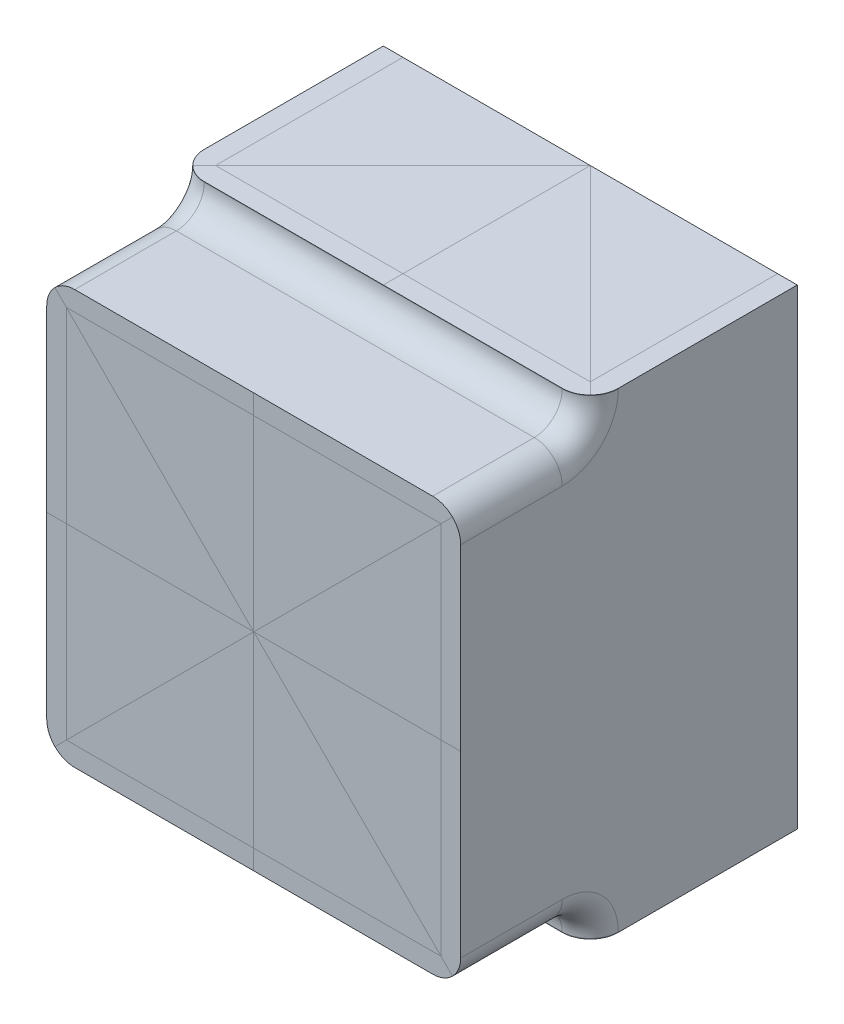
ISO-10303-21;
HEADER;
FILE_DESCRIPTION(('STEP AP214'),'2;1');
FILE_NAME('part.step','',(''),(''),'','','');
FILE_SCHEMA(('AUTOMOTIVE_DESIGN { 1 0 10303 214 1 1 1 1 }'));
ENDSEC;
DATA;
#1=APPLICATION_CONTEXT('core data for automotive mechanical design processes');
#2=APPLICATION_PROTOCOL_DEFINITION('international standard','automotive_design',2000,#1);
#3=PRODUCT_CONTEXT('',#1,'mechanical');
#4=PRODUCT('Part','Part','',(#3));
#5=PRODUCT_RELATED_PRODUCT_CATEGORY('part','',(#4));
#6=PRODUCT_DEFINITION_FORMATION('','',#4);
#7=PRODUCT_DEFINITION_CONTEXT('part definition',#1,'design');
#8=PRODUCT_DEFINITION('design','',#6,#7);
#9=PRODUCT_DEFINITION_SHAPE('','',#8);
#10=(LENGTH_UNIT() NAMED_UNIT(*) SI_UNIT(.MILLI.,.METRE.));
#11=(NAMED_UNIT(*) PLANE_ANGLE_UNIT() SI_UNIT($,.RADIAN.));
#12=(NAMED_UNIT(*) SI_UNIT($,.STERADIAN.) SOLID_ANGLE_UNIT());
#13=UNCERTAINTY_MEASURE_WITH_UNIT(LENGTH_MEASURE(1.E-05),#10,'distance_accuracy_value','');
#14=(GEOMETRIC_REPRESENTATION_CONTEXT(3) GLOBAL_UNCERTAINTY_ASSIGNED_CONTEXT((#13)) GLOBAL_UNIT_ASSIGNED_CONTEXT((#10,
#11,#12)) REPRESENTATION_CONTEXT('',''));
#15=CARTESIAN_POINT('',(0.,0.,0.));
#16=DIRECTION('',(0.,0.,1.));
#17=DIRECTION('',(1.,0.,0.));
#18=AXIS2_PLACEMENT_3D('',#15,#16,#17);
#19=CARTESIAN_POINT('',(0.,-10500.,0.));
#20=DIRECTION('',(0.,1.,0.));
#21=DIRECTION('',(0.,0.,1.));
#22=AXIS2_PLACEMENT_3D('',#19,#20,#21);
#23=PLANE('',#22);
#24=DIRECTION('',(0.707106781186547,0.,0.707106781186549));
#25=VECTOR('',#24,1.);
#26=CARTESIAN_POINT('',(-2.51214793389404E-12,-10500.,2.51214793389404E-12));
#27=LINE('',#26,#25);
#28=CARTESIAN_POINT('',(8350.,-10500.,8350.));
#29=VERTEX_POINT('',#28);
#30=CARTESIAN_POINT('',(8859.05921241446,-10500.,8859.05921241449));
#31=VERTEX_POINT('',#30);
#32=EDGE_CURVE('E11',#29,#31,#27,.T.);
#33=ORIENTED_EDGE('',*,*,#32,.F.);
#34=DIRECTION('',(0.,0.,1.));
#35=VECTOR('',#34,1.);
#36=CARTESIAN_POINT('',(8350.,-10500.,-8.88178419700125E-13));
#37=LINE('',#36,#35);
#38=CARTESIAN_POINT('',(8350.,-10500.,0.));
#39=VERTEX_POINT('',#38);
#40=EDGE_CURVE('E385',#39,#29,#37,.T.);
#41=ORIENTED_EDGE('',*,*,#40,.F.);
#42=DIRECTION('',(-1.,0.,0.));
#43=VECTOR('',#42,1.);
#44=CARTESIAN_POINT('',(9225.,-10500.,0.));
#45=LINE('',#44,#43);
#46=CARTESIAN_POINT('',(9225.,-10500.,0.));
#47=VERTEX_POINT('',#46);
#48=EDGE_CURVE('E775',#47,#39,#45,.T.);
#49=ORIENTED_EDGE('',*,*,#48,.F.);
#50=DIRECTION('',(0.,0.,-1.));
#51=VECTOR('',#50,1.);
#52=CARTESIAN_POINT('',(9225.,-10500.,9225.));
#53=LINE('',#52,#51);
#54=CARTESIAN_POINT('',(9225.,-10500.,7975.6));
#55=VERTEX_POINT('',#54);
#56=EDGE_CURVE('E642',#55,#47,#53,.T.);
#57=ORIENTED_EDGE('',*,*,#56,.F.);
#58=CARTESIAN_POINT('',(7975.6,-10500.,7975.6));
#59=DIRECTION('',(0.,1.,0.));
#60=DIRECTION('',(0.,0.,1.));
#61=AXIS2_PLACEMENT_3D('',#58,#59,#60);
#62=CIRCLE('',#61,1249.4);
#63=EDGE_CURVE('E731',#55,#31,#62,.F.);
#64=ORIENTED_EDGE('',*,*,#63,.T.);
#65=EDGE_LOOP('',(#33,#41,#49,#57,#64));
#66=FACE_BOUND('',#65,.T.);
#67=ADVANCED_FACE('F47',(#66),#23,.F.);
#68=CARTESIAN_POINT('',(0.,10500.,0.));
#69=DIRECTION('',(0.,1.,0.));
#70=DIRECTION('',(0.,0.,1.));
#71=AXIS2_PLACEMENT_3D('',#68,#69,#70);
#72=PLANE('',#71);
#73=DIRECTION('',(0.,0.,1.));
#74=VECTOR('',#73,1.);
#75=CARTESIAN_POINT('',(8350.,10500.,-8.88178419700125E-13));
#76=LINE('',#75,#74);
#77=CARTESIAN_POINT('',(8350.,10500.,0.));
#78=VERTEX_POINT('',#77);
#79=CARTESIAN_POINT('',(8350.,10500.,8350.));
#80=VERTEX_POINT('',#79);
#81=EDGE_CURVE('E470',#78,#80,#76,.T.);
#82=ORIENTED_EDGE('',*,*,#81,.T.);
#83=DIRECTION('',(0.707106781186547,0.,0.707106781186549));
#84=VECTOR('',#83,1.);
#85=CARTESIAN_POINT('',(-2.51214793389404E-12,10500.,2.51214793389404E-12));
#86=LINE('',#85,#84);
#87=CARTESIAN_POINT('',(8859.05921241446,10500.,8859.05921241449));
#88=VERTEX_POINT('',#87);
#89=EDGE_CURVE('E56',#80,#88,#86,.T.);
#90=ORIENTED_EDGE('',*,*,#89,.T.);
#91=CARTESIAN_POINT('',(7975.6,10500.,7975.6));
#92=DIRECTION('',(0.,1.,0.));
#93=DIRECTION('',(0.,0.,1.));
#94=AXIS2_PLACEMENT_3D('',#91,#92,#93);
#95=CIRCLE('',#94,1249.4);
#96=CARTESIAN_POINT('',(9225.,10500.,7975.6));
#97=VERTEX_POINT('',#96);
#98=EDGE_CURVE('E345',#88,#97,#95,.T.);
#99=ORIENTED_EDGE('',*,*,#98,.T.);
#100=DIRECTION('',(0.,0.,-1.));
#101=VECTOR('',#100,1.);
#102=CARTESIAN_POINT('',(9225.,10500.,9225.));
#103=LINE('',#102,#101);
#104=CARTESIAN_POINT('',(9225.,10500.,0.));
#105=VERTEX_POINT('',#104);
#106=EDGE_CURVE('E328',#97,#105,#103,.T.);
#107=ORIENTED_EDGE('',*,*,#106,.T.);
#108=DIRECTION('',(-1.,0.,0.));
#109=VECTOR('',#108,1.);
#110=CARTESIAN_POINT('',(9225.,10500.,0.));
#111=LINE('',#110,#109);
#112=EDGE_CURVE('E342',#105,#78,#111,.T.);
#113=ORIENTED_EDGE('',*,*,#112,.T.);
#114=EDGE_LOOP('',(#82,#90,#99,#107,#113));
#115=FACE_BOUND('',#114,.T.);
#116=ADVANCED_FACE('F338',(#115),#72,.T.);
#117=DIRECTION('',(0.707106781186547,0.,0.707106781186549));
#118=VECTOR('',#117,1.);
#119=CARTESIAN_POINT('',(-2.51214793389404E-12,-10500.,2.51214793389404E-12));
#120=LINE('',#119,#118);
#121=CARTESIAN_POINT('',(-1.77635683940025E-12,-10500.,0.));
#122=VERTEX_POINT('',#121);
#123=EDGE_CURVE('E431',#122,#29,#120,.T.);
#124=ORIENTED_EDGE('',*,*,#123,.F.);
#125=EDGE_CURVE('E773',#39,#122,#45,.T.);
#126=ORIENTED_EDGE('',*,*,#125,.F.);
#127=ORIENTED_EDGE('',*,*,#40,.T.);
#128=EDGE_LOOP('',(#124,#126,#127));
#129=FACE_BOUND('',#128,.T.);
#130=ADVANCED_FACE('F1048',(#129),#23,.F.);
#131=CARTESIAN_POINT('',(-1.77635683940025E-12,10500.,0.));
#132=VERTEX_POINT('',#131);
#133=EDGE_CURVE('E347',#78,#132,#111,.T.);
#134=ORIENTED_EDGE('',*,*,#133,.T.);
#135=DIRECTION('',(0.707106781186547,0.,0.707106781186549));
#136=VECTOR('',#135,1.);
#137=CARTESIAN_POINT('',(-2.51214793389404E-12,10500.,2.51214793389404E-12));
#138=LINE('',#137,#136);
#139=EDGE_CURVE('E52',#132,#80,#138,.T.);
#140=ORIENTED_EDGE('',*,*,#139,.T.);
#141=ORIENTED_EDGE('',*,*,#81,.F.);
#142=EDGE_LOOP('',(#134,#140,#141));
#143=FACE_BOUND('',#142,.T.);
#144=ADVANCED_FACE('F1042',(#143),#72,.T.);
#145=DIRECTION('',(-1.,0.,0.));
#146=VECTOR('',#145,1.);
#147=CARTESIAN_POINT('',(0.,-10500.,8350.));
#148=LINE('',#147,#146);
#149=CARTESIAN_POINT('',(-2.36095865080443E-12,-10500.,8350.));
#150=VERTEX_POINT('',#149);
#151=EDGE_CURVE('E405',#29,#150,#148,.T.);
#152=ORIENTED_EDGE('',*,*,#151,.F.);
#153=ORIENTED_EDGE('',*,*,#32,.T.);
#154=CARTESIAN_POINT('',(7975.6,-10500.,9225.));
#155=VERTEX_POINT('',#154);
#156=EDGE_CURVE('E736',#31,#155,#62,.F.);
#157=ORIENTED_EDGE('',*,*,#156,.T.);
#158=DIRECTION('',(1.,0.,0.));
#159=VECTOR('',#158,1.);
#160=CARTESIAN_POINT('',(9225.,-10500.,9225.));
#161=LINE('',#160,#159);
#162=CARTESIAN_POINT('',(-1.77635683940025E-12,-10500.,9225.));
#163=VERTEX_POINT('',#162);
#164=EDGE_CURVE('E767',#163,#155,#161,.T.);
#165=ORIENTED_EDGE('',*,*,#164,.F.);
#166=DIRECTION('',(0.,0.,1.));
#167=VECTOR('',#166,1.);
#168=CARTESIAN_POINT('',(-2.36095865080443E-12,-10500.,0.));
#169=LINE('',#168,#167);
#170=EDGE_CURVE('E418',#150,#163,#169,.T.);
#171=ORIENTED_EDGE('',*,*,#170,.F.);
#172=EDGE_LOOP('',(#152,#153,#157,#165,#171));
#173=FACE_BOUND('',#172,.T.);
#174=ADVANCED_FACE('F1045',(#173),#23,.F.);
#175=ORIENTED_EDGE('',*,*,#89,.F.);
#176=DIRECTION('',(-1.,0.,0.));
#177=VECTOR('',#176,1.);
#178=CARTESIAN_POINT('',(0.,10500.,8350.));
#179=LINE('',#178,#177);
#180=CARTESIAN_POINT('',(-2.36095865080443E-12,10500.,8350.));
#181=VERTEX_POINT('',#180);
#182=EDGE_CURVE('E384',#80,#181,#179,.T.);
#183=ORIENTED_EDGE('',*,*,#182,.T.);
#184=DIRECTION('',(0.,0.,1.));
#185=VECTOR('',#184,1.);
#186=CARTESIAN_POINT('',(-2.36095865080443E-12,10500.,0.));
#187=LINE('',#186,#185);
#188=CARTESIAN_POINT('',(-1.77635683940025E-12,10500.,9225.));
#189=VERTEX_POINT('',#188);
#190=EDGE_CURVE('E423',#181,#189,#187,.T.);
#191=ORIENTED_EDGE('',*,*,#190,.T.);
#192=DIRECTION('',(1.,0.,0.));
#193=VECTOR('',#192,1.);
#194=CARTESIAN_POINT('',(9225.,10500.,9225.));
#195=LINE('',#194,#193);
#196=CARTESIAN_POINT('',(7975.6,10500.,9225.));
#197=VERTEX_POINT('',#196);
#198=EDGE_CURVE('E354',#189,#197,#195,.T.);
#199=ORIENTED_EDGE('',*,*,#198,.T.);
#200=EDGE_CURVE('E703',#197,#88,#95,.T.);
#201=ORIENTED_EDGE('',*,*,#200,.T.);
#202=EDGE_LOOP('',(#175,#183,#191,#199,#201));
#203=FACE_BOUND('',#202,.T.);
#204=ADVANCED_FACE('F790',(#203),#72,.T.);
#205=DIRECTION('',(0.,0.,1.));
#206=VECTOR('',#205,1.);
#207=CARTESIAN_POINT('',(-2.36095865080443E-12,-10500.,0.));
#208=LINE('',#207,#206);
#209=EDGE_CURVE('E422',#122,#150,#208,.T.);
#210=ORIENTED_EDGE('',*,*,#209,.F.);
#211=ORIENTED_EDGE('',*,*,#123,.T.);
#212=ORIENTED_EDGE('',*,*,#151,.T.);
#213=EDGE_LOOP('',(#210,#211,#212));
#214=FACE_BOUND('',#213,.T.);
#215=ADVANCED_FACE('F1050',(#214),#23,.F.);
#216=ORIENTED_EDGE('',*,*,#139,.F.);
#217=DIRECTION('',(0.,0.,1.));
#218=VECTOR('',#217,1.);
#219=CARTESIAN_POINT('',(-2.36095865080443E-12,10500.,0.));
#220=LINE('',#219,#218);
#221=EDGE_CURVE('E409',#132,#181,#220,.T.);
#222=ORIENTED_EDGE('',*,*,#221,.T.);
#223=ORIENTED_EDGE('',*,*,#182,.F.);
#224=EDGE_LOOP('',(#216,#222,#223));
#225=FACE_BOUND('',#224,.T.);
#226=ADVANCED_FACE('F1054',(#225),#72,.T.);
#227=CARTESIAN_POINT('',(-7975.6,10500.,7975.6));
#228=DIRECTION('',(0.,1.,0.));
#229=DIRECTION('',(0.,0.,1.));
#230=AXIS2_PLACEMENT_3D('',#227,#228,#229);
#231=CIRCLE('',#230,1249.4);
#232=CARTESIAN_POINT('',(-9225.,10500.,7975.6));
#233=VERTEX_POINT('',#232);
#234=CARTESIAN_POINT('',(-8859.05921241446,10500.,8859.05921241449));
#235=VERTEX_POINT('',#234);
#236=EDGE_CURVE('E701',#233,#235,#231,.T.);
#237=ORIENTED_EDGE('',*,*,#236,.T.);
#238=DIRECTION('',(0.707106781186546,0.,-0.707106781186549));
#239=VECTOR('',#238,1.);
#240=CARTESIAN_POINT('',(0.,10500.,0.));
#241=LINE('',#240,#239);
#242=CARTESIAN_POINT('',(-8350.,10500.,8350.));
#243=VERTEX_POINT('',#242);
#244=EDGE_CURVE('E379',#235,#243,#241,.T.);
#245=ORIENTED_EDGE('',*,*,#244,.T.);
#246=DIRECTION('',(0.,0.,-1.));
#247=VECTOR('',#246,1.);
#248=CARTESIAN_POINT('',(-8350.,10500.,1.77635683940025E-12));
#249=LINE('',#248,#247);
#250=CARTESIAN_POINT('',(-8350.,10500.,0.));
#251=VERTEX_POINT('',#250);
#252=EDGE_CURVE('E361',#243,#251,#249,.T.);
#253=ORIENTED_EDGE('',*,*,#252,.T.);
#254=CARTESIAN_POINT('',(-9225.,10500.,0.));
#255=VERTEX_POINT('',#254);
#256=EDGE_CURVE('E344',#251,#255,#111,.T.);
#257=ORIENTED_EDGE('',*,*,#256,.T.);
#258=DIRECTION('',(0.,0.,1.));
#259=VECTOR('',#258,1.);
#260=CARTESIAN_POINT('',(-9225.,10500.,9225.));
#261=LINE('',#260,#259);
#262=EDGE_CURVE('E351',#255,#233,#261,.T.);
#263=ORIENTED_EDGE('',*,*,#262,.T.);
#264=EDGE_LOOP('',(#237,#245,#253,#257,#263));
#265=FACE_BOUND('',#264,.T.);
#266=ADVANCED_FACE('F380',(#265),#72,.T.);
#267=ORIENTED_EDGE('',*,*,#252,.F.);
#268=DIRECTION('',(0.707106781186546,0.,-0.707106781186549));
#269=VECTOR('',#268,1.);
#270=CARTESIAN_POINT('',(0.,10500.,0.));
#271=LINE('',#270,#269);
#272=EDGE_CURVE('E362',#243,#132,#271,.T.);
#273=ORIENTED_EDGE('',*,*,#272,.T.);
#274=EDGE_CURVE('E353',#132,#251,#111,.T.);
#275=ORIENTED_EDGE('',*,*,#274,.T.);
#276=EDGE_LOOP('',(#267,#273,#275));
#277=FACE_BOUND('',#276,.T.);
#278=ADVANCED_FACE('F365',(#277),#72,.T.);
#279=DIRECTION('',(0.707106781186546,0.,-0.707106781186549));
#280=VECTOR('',#279,1.);
#281=CARTESIAN_POINT('',(0.,-10500.,0.));
#282=LINE('',#281,#280);
#283=CARTESIAN_POINT('',(-8859.05921241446,-10500.,8859.05921241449));
#284=VERTEX_POINT('',#283);
#285=CARTESIAN_POINT('',(-8350.,-10500.,8350.));
#286=VERTEX_POINT('',#285);
#287=EDGE_CURVE('E414',#284,#286,#282,.T.);
#288=ORIENTED_EDGE('',*,*,#287,.F.);
#289=CARTESIAN_POINT('',(-7975.6,-10500.,7975.6));
#290=DIRECTION('',(0.,1.,0.));
#291=DIRECTION('',(0.,0.,1.));
#292=AXIS2_PLACEMENT_3D('',#289,#290,#291);
#293=CIRCLE('',#292,1249.4);
#294=CARTESIAN_POINT('',(-9225.,-10500.,7975.6));
#295=VERTEX_POINT('',#294);
#296=EDGE_CURVE('E734',#284,#295,#293,.F.);
#297=ORIENTED_EDGE('',*,*,#296,.T.);
#298=DIRECTION('',(0.,0.,1.));
#299=VECTOR('',#298,1.);
#300=CARTESIAN_POINT('',(-9225.,-10500.,9225.));
#301=LINE('',#300,#299);
#302=CARTESIAN_POINT('',(-9225.,-10500.,0.));
#303=VERTEX_POINT('',#302);
#304=EDGE_CURVE('E768',#303,#295,#301,.T.);
#305=ORIENTED_EDGE('',*,*,#304,.F.);
#306=CARTESIAN_POINT('',(-8350.,-10500.,0.));
#307=VERTEX_POINT('',#306);
#308=EDGE_CURVE('E779',#307,#303,#45,.T.);
#309=ORIENTED_EDGE('',*,*,#308,.F.);
#310=DIRECTION('',(0.,0.,-1.));
#311=VECTOR('',#310,1.);
#312=CARTESIAN_POINT('',(-8350.,-10500.,1.77635683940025E-12));
#313=LINE('',#312,#311);
#314=EDGE_CURVE('E398',#286,#307,#313,.T.);
#315=ORIENTED_EDGE('',*,*,#314,.F.);
#316=EDGE_LOOP('',(#288,#297,#305,#309,#315));
#317=FACE_BOUND('',#316,.T.);
#318=ADVANCED_FACE('F1058',(#317),#23,.F.);
#319=DIRECTION('',(0.707106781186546,0.,-0.707106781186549));
#320=VECTOR('',#319,1.);
#321=CARTESIAN_POINT('',(0.,-10500.,0.));
#322=LINE('',#321,#320);
#323=EDGE_CURVE('E402',#286,#122,#322,.T.);
#324=ORIENTED_EDGE('',*,*,#323,.F.);
#325=ORIENTED_EDGE('',*,*,#314,.T.);
#326=EDGE_CURVE('E777',#122,#307,#45,.T.);
#327=ORIENTED_EDGE('',*,*,#326,.F.);
#328=EDGE_LOOP('',(#324,#325,#327));
#329=FACE_BOUND('',#328,.T.);
#330=ADVANCED_FACE('F1083',(#329),#23,.F.);
#331=EDGE_CURVE('E394',#150,#286,#148,.T.);
#332=ORIENTED_EDGE('',*,*,#331,.F.);
#333=ORIENTED_EDGE('',*,*,#170,.T.);
#334=CARTESIAN_POINT('',(-7975.6,-10500.,9225.));
#335=VERTEX_POINT('',#334);
#336=EDGE_CURVE('E341',#335,#163,#161,.T.);
#337=ORIENTED_EDGE('',*,*,#336,.F.);
#338=EDGE_CURVE('E728',#335,#284,#293,.F.);
#339=ORIENTED_EDGE('',*,*,#338,.T.);
#340=ORIENTED_EDGE('',*,*,#287,.T.);
#341=EDGE_LOOP('',(#332,#333,#337,#339,#340));
#342=FACE_BOUND('',#341,.T.);
#343=ADVANCED_FACE('F1044',(#342),#23,.F.);
#344=ORIENTED_EDGE('',*,*,#190,.F.);
#345=EDGE_CURVE('E393',#181,#243,#179,.T.);
#346=ORIENTED_EDGE('',*,*,#345,.T.);
#347=ORIENTED_EDGE('',*,*,#244,.F.);
#348=CARTESIAN_POINT('',(-7975.6,10500.,9225.));
#349=VERTEX_POINT('',#348);
#350=EDGE_CURVE('E702',#235,#349,#231,.T.);
#351=ORIENTED_EDGE('',*,*,#350,.T.);
#352=EDGE_CURVE('E776',#349,#189,#195,.T.);
#353=ORIENTED_EDGE('',*,*,#352,.T.);
#354=EDGE_LOOP('',(#344,#346,#347,#351,#353));
#355=FACE_BOUND('',#354,.T.);
#356=ADVANCED_FACE('F1085',(#355),#72,.T.);
#357=CARTESIAN_POINT('',(0.,0.,0.));
#358=DIRECTION('',(0.,0.,1.));
#359=DIRECTION('',(1.,0.,0.));
#360=AXIS2_PLACEMENT_3D('',#357,#358,#359);
#361=PLANE('',#360);
#362=DIRECTION('',(-0.707106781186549,-0.707106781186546,0.));
#363=VECTOR('',#362,1.);
#364=CARTESIAN_POINT('',(-2.51214793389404E-12,2.51214793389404E-12,0.));
#365=LINE('',#364,#363);
#366=CARTESIAN_POINT('',(-8350.,-8350.,0.));
#367=VERTEX_POINT('',#366);
#368=CARTESIAN_POINT('',(-9225.,-9224.99999999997,0.));
#369=VERTEX_POINT('',#368);
#370=EDGE_CURVE('E479',#367,#369,#365,.T.);
#371=ORIENTED_EDGE('',*,*,#370,.F.);
#372=DIRECTION('',(-1.,0.,0.));
#373=VECTOR('',#372,1.);
#374=CARTESIAN_POINT('',(1.77635683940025E-12,-8350.,0.));
#375=LINE('',#374,#373);
#376=CARTESIAN_POINT('',(-2.28583469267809E-12,-8350.,0.));
#377=VERTEX_POINT('',#376);
#378=EDGE_CURVE('E581',#377,#367,#375,.T.);
#379=ORIENTED_EDGE('',*,*,#378,.F.);
#380=DIRECTION('',(0.,-1.,0.));
#381=VECTOR('',#380,1.);
#382=CARTESIAN_POINT('',(-2.28583469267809E-12,0.,0.));
#383=LINE('',#382,#381);
#384=EDGE_CURVE('E568',#377,#122,#383,.T.);
#385=ORIENTED_EDGE('',*,*,#384,.T.);
#386=ORIENTED_EDGE('',*,*,#326,.T.);
#387=ORIENTED_EDGE('',*,*,#308,.T.);
#388=DIRECTION('',(0.,-1.,0.));
#389=VECTOR('',#388,1.);
#390=CARTESIAN_POINT('',(-9225.,-9225.,0.));
#391=LINE('',#390,#389);
#392=EDGE_CURVE('E753',#369,#303,#391,.T.);
#393=ORIENTED_EDGE('',*,*,#392,.F.);
#394=EDGE_LOOP('',(#371,#379,#385,#386,#387,#393));
#395=FACE_BOUND('',#394,.T.);
#396=ADVANCED_FACE('F1079',(#395),#361,.F.);
#397=CARTESIAN_POINT('',(0.,0.,15000.));
#398=DIRECTION('',(0.,0.,1.));
#399=DIRECTION('',(1.,0.,0.));
#400=AXIS2_PLACEMENT_3D('',#397,#398,#399);
#401=PLANE('',#400);
#402=DIRECTION('',(-1.,0.,0.));
#403=VECTOR('',#402,1.);
#404=CARTESIAN_POINT('',(1.77635683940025E-12,-8350.,15000.));
#405=LINE('',#404,#403);
#406=CARTESIAN_POINT('',(-2.28583469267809E-12,-8350.,15000.));
#407=VERTEX_POINT('',#406);
#408=CARTESIAN_POINT('',(-8350.,-8350.,15000.));
#409=VERTEX_POINT('',#408);
#410=EDGE_CURVE('E612',#407,#409,#405,.T.);
#411=ORIENTED_EDGE('',*,*,#410,.T.);
#412=DIRECTION('',(-0.707106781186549,-0.707106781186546,0.));
#413=VECTOR('',#412,1.);
#414=CARTESIAN_POINT('',(-2.51214793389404E-12,2.51214793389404E-12,15000.));
#415=LINE('',#414,#413);
#416=CARTESIAN_POINT('',(-8859.05921241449,-8859.05921241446,15000.));
#417=VERTEX_POINT('',#416);
#418=EDGE_CURVE('E480',#409,#417,#415,.T.);
#419=ORIENTED_EDGE('',*,*,#418,.T.);
#420=CARTESIAN_POINT('',(-7975.6,-7975.6,15000.));
#421=DIRECTION('',(0.,0.,1.));
#422=DIRECTION('',(1.,0.,0.));
#423=AXIS2_PLACEMENT_3D('',#420,#421,#422);
#424=CIRCLE('',#423,1249.4);
#425=CARTESIAN_POINT('',(-7975.6,-9225.,15000.));
#426=VERTEX_POINT('',#425);
#427=EDGE_CURVE('E683',#417,#426,#424,.T.);
#428=ORIENTED_EDGE('',*,*,#427,.T.);
#429=DIRECTION('',(1.,0.,0.));
#430=VECTOR('',#429,1.);
#431=CARTESIAN_POINT('',(-9225.,-9225.,15000.));
#432=LINE('',#431,#430);
#433=CARTESIAN_POINT('',(-1.77635683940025E-12,-9225.,15000.));
#434=VERTEX_POINT('',#433);
#435=EDGE_CURVE('E752',#426,#434,#432,.T.);
#436=ORIENTED_EDGE('',*,*,#435,.T.);
#437=DIRECTION('',(0.,-1.,0.));
#438=VECTOR('',#437,1.);
#439=CARTESIAN_POINT('',(-2.28583469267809E-12,0.,15000.));
#440=LINE('',#439,#438);
#441=EDGE_CURVE('E580',#407,#434,#440,.T.);
#442=ORIENTED_EDGE('',*,*,#441,.F.);
#443=EDGE_LOOP('',(#411,#419,#428,#436,#442));
#444=FACE_BOUND('',#443,.T.);
#445=ADVANCED_FACE('F1004',(#444),#401,.T.);
#446=DIRECTION('',(0.,-1.,0.));
#447=VECTOR('',#446,1.);
#448=CARTESIAN_POINT('',(-2.28583469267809E-12,0.,15000.));
#449=LINE('',#448,#447);
#450=CARTESIAN_POINT('',(-2.28583469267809E-12,-2.73846117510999E-12,15000.));
#451=VERTEX_POINT('',#450);
#452=EDGE_CURVE('E575',#451,#407,#449,.T.);
#453=ORIENTED_EDGE('',*,*,#452,.F.);
#454=DIRECTION('',(-0.707106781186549,-0.707106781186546,0.));
#455=VECTOR('',#454,1.);
#456=CARTESIAN_POINT('',(-2.51214793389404E-12,2.51214793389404E-12,15000.));
#457=LINE('',#456,#455);
#458=EDGE_CURVE('E491',#451,#409,#457,.T.);
#459=ORIENTED_EDGE('',*,*,#458,.T.);
#460=ORIENTED_EDGE('',*,*,#410,.F.);
#461=EDGE_LOOP('',(#453,#459,#460));
#462=FACE_BOUND('',#461,.T.);
#463=ADVANCED_FACE('F1007',(#462),#401,.T.);
#464=DIRECTION('',(-0.707106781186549,-0.707106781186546,0.));
#465=VECTOR('',#464,1.);
#466=CARTESIAN_POINT('',(-2.51214793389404E-12,2.51214793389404E-12,0.));
#467=LINE('',#466,#465);
#468=CARTESIAN_POINT('',(-2.28583469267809E-12,-2.73846117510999E-12,0.));
#469=VERTEX_POINT('',#468);
#470=EDGE_CURVE('E489',#469,#367,#467,.T.);
#471=ORIENTED_EDGE('',*,*,#470,.F.);
#472=DIRECTION('',(0.,-1.,0.));
#473=VECTOR('',#472,1.);
#474=CARTESIAN_POINT('',(-2.28583469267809E-12,0.,0.));
#475=LINE('',#474,#473);
#476=EDGE_CURVE('E567',#469,#377,#475,.T.);
#477=ORIENTED_EDGE('',*,*,#476,.T.);
#478=ORIENTED_EDGE('',*,*,#378,.T.);
#479=EDGE_LOOP('',(#471,#477,#478));
#480=FACE_BOUND('',#479,.T.);
#481=ADVANCED_FACE('F1205',(#480),#361,.F.);
#482=CARTESIAN_POINT('',(7975.6,7975.6,15000.));
#483=DIRECTION('',(0.,0.,1.));
#484=DIRECTION('',(1.,0.,0.));
#485=AXIS2_PLACEMENT_3D('',#482,#483,#484);
#486=CIRCLE('',#485,1249.4);
#487=CARTESIAN_POINT('',(9225.,7975.6,15000.));
#488=VERTEX_POINT('',#487);
#489=CARTESIAN_POINT('',(8859.05921241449,8859.05921241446,15000.));
#490=VERTEX_POINT('',#489);
#491=EDGE_CURVE('E687',#488,#490,#486,.T.);
#492=ORIENTED_EDGE('',*,*,#491,.T.);
#493=DIRECTION('',(-0.707106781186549,-0.707106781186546,0.));
#494=VECTOR('',#493,1.);
#495=CARTESIAN_POINT('',(-2.51214793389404E-12,2.51214793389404E-12,15000.));
#496=LINE('',#495,#494);
#497=CARTESIAN_POINT('',(8350.,8350.,15000.));
#498=VERTEX_POINT('',#497);
#499=EDGE_CURVE('E494',#490,#498,#496,.T.);
#500=ORIENTED_EDGE('',*,*,#499,.T.);
#501=DIRECTION('',(0.,-1.,0.));
#502=VECTOR('',#501,1.);
#503=CARTESIAN_POINT('',(8350.,0.,15000.));
#504=LINE('',#503,#502);
#505=CARTESIAN_POINT('',(8350.,7.5064563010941E-13,15000.));
#506=VERTEX_POINT('',#505);
#507=EDGE_CURVE('E614',#498,#506,#504,.T.);
#508=ORIENTED_EDGE('',*,*,#507,.T.);
#509=DIRECTION('',(-1.,0.,0.));
#510=VECTOR('',#509,1.);
#511=CARTESIAN_POINT('',(0.,-5.27355936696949E-13,15000.));
#512=LINE('',#511,#510);
#513=CARTESIAN_POINT('',(9225.,0.,15000.));
#514=VERTEX_POINT('',#513);
#515=EDGE_CURVE('E488',#514,#506,#512,.T.);
#516=ORIENTED_EDGE('',*,*,#515,.F.);
#517=DIRECTION('',(0.,1.,0.));
#518=VECTOR('',#517,1.);
#519=CARTESIAN_POINT('',(9225.,-9225.,15000.));
#520=LINE('',#519,#518);
#521=EDGE_CURVE('E754',#514,#488,#520,.T.);
#522=ORIENTED_EDGE('',*,*,#521,.T.);
#523=EDGE_LOOP('',(#492,#500,#508,#516,#522));
#524=FACE_BOUND('',#523,.T.);
#525=ADVANCED_FACE('F827',(#524),#401,.T.);
#526=ORIENTED_EDGE('',*,*,#507,.F.);
#527=DIRECTION('',(-0.707106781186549,-0.707106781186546,0.));
#528=VECTOR('',#527,1.);
#529=CARTESIAN_POINT('',(-2.51214793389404E-12,2.51214793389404E-12,15000.));
#530=LINE('',#529,#528);
#531=EDGE_CURVE('E490',#498,#451,#530,.T.);
#532=ORIENTED_EDGE('',*,*,#531,.T.);
#533=DIRECTION('',(-1.,0.,0.));
#534=VECTOR('',#533,1.);
#535=CARTESIAN_POINT('',(0.,-5.27355936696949E-13,15000.));
#536=LINE('',#535,#534);
#537=EDGE_CURVE('E525',#506,#451,#536,.T.);
#538=ORIENTED_EDGE('',*,*,#537,.F.);
#539=EDGE_LOOP('',(#526,#532,#538));
#540=FACE_BOUND('',#539,.T.);
#541=ADVANCED_FACE('F1014',(#540),#401,.T.);
#542=DIRECTION('',(-0.707106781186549,-0.707106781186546,0.));
#543=VECTOR('',#542,1.);
#544=CARTESIAN_POINT('',(-2.51214793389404E-12,2.51214793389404E-12,0.));
#545=LINE('',#544,#543);
#546=CARTESIAN_POINT('',(9225.,9224.99999999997,0.));
#547=VERTEX_POINT('',#546);
#548=CARTESIAN_POINT('',(8350.,8350.,0.));
#549=VERTEX_POINT('',#548);
#550=EDGE_CURVE('E484',#547,#549,#545,.T.);
#551=ORIENTED_EDGE('',*,*,#550,.F.);
#552=DIRECTION('',(0.,1.,0.));
#553=VECTOR('',#552,1.);
#554=CARTESIAN_POINT('',(9225.,-9225.,0.));
#555=LINE('',#554,#553);
#556=CARTESIAN_POINT('',(9225.,0.,0.));
#557=VERTEX_POINT('',#556);
#558=EDGE_CURVE('E333',#557,#547,#555,.T.);
#559=ORIENTED_EDGE('',*,*,#558,.F.);
#560=DIRECTION('',(-1.,0.,0.));
#561=VECTOR('',#560,1.);
#562=CARTESIAN_POINT('',(0.,-5.27355936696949E-13,0.));
#563=LINE('',#562,#561);
#564=CARTESIAN_POINT('',(8350.,7.5064563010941E-13,0.));
#565=VERTEX_POINT('',#564);
#566=EDGE_CURVE('E518',#557,#565,#563,.T.);
#567=ORIENTED_EDGE('',*,*,#566,.T.);
#568=DIRECTION('',(0.,-1.,0.));
#569=VECTOR('',#568,1.);
#570=CARTESIAN_POINT('',(8350.,0.,0.));
#571=LINE('',#570,#569);
#572=EDGE_CURVE('E578',#549,#565,#571,.T.);
#573=ORIENTED_EDGE('',*,*,#572,.F.);
#574=EDGE_LOOP('',(#551,#559,#567,#573));
#575=FACE_BOUND('',#574,.T.);
#576=ADVANCED_FACE('F889',(#575),#361,.F.);
#577=DIRECTION('',(-0.707106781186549,-0.707106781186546,0.));
#578=VECTOR('',#577,1.);
#579=CARTESIAN_POINT('',(-2.51214793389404E-12,2.51214793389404E-12,0.));
#580=LINE('',#579,#578);
#581=EDGE_CURVE('E481',#549,#469,#580,.T.);
#582=ORIENTED_EDGE('',*,*,#581,.F.);
#583=ORIENTED_EDGE('',*,*,#572,.T.);
#584=DIRECTION('',(-1.,0.,0.));
#585=VECTOR('',#584,1.);
#586=CARTESIAN_POINT('',(0.,-5.27355936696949E-13,0.));
#587=LINE('',#586,#585);
#588=EDGE_CURVE('E513',#565,#469,#587,.T.);
#589=ORIENTED_EDGE('',*,*,#588,.T.);
#590=EDGE_LOOP('',(#582,#583,#589));
#591=FACE_BOUND('',#590,.T.);
#592=ADVANCED_FACE('F894',(#591),#361,.F.);
#593=CARTESIAN_POINT('',(9225.,-7975.6,15000.));
#594=VERTEX_POINT('',#593);
#595=EDGE_CURVE('E742',#594,#514,#520,.T.);
#596=ORIENTED_EDGE('',*,*,#595,.T.);
#597=ORIENTED_EDGE('',*,*,#515,.T.);
#598=CARTESIAN_POINT('',(8350.,-8350.,15000.));
#599=VERTEX_POINT('',#598);
#600=EDGE_CURVE('E620',#506,#599,#504,.T.);
#601=ORIENTED_EDGE('',*,*,#600,.T.);
#602=DIRECTION('',(0.707106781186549,-0.707106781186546,0.));
#603=VECTOR('',#602,1.);
#604=CARTESIAN_POINT('',(-2.51214793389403E-12,-2.51214793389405E-12,15000.));
#605=LINE('',#604,#603);
#606=CARTESIAN_POINT('',(8859.05921241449,-8859.05921241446,15000.));
#607=VERTEX_POINT('',#606);
#608=EDGE_CURVE('E512',#599,#607,#605,.T.);
#609=ORIENTED_EDGE('',*,*,#608,.T.);
#610=CARTESIAN_POINT('',(7975.6,-7975.6,15000.));
#611=DIRECTION('',(0.,0.,1.));
#612=DIRECTION('',(1.,0.,0.));
#613=AXIS2_PLACEMENT_3D('',#610,#611,#612);
#614=CIRCLE('',#613,1249.4);
#615=EDGE_CURVE('E684',#607,#594,#614,.T.);
#616=ORIENTED_EDGE('',*,*,#615,.T.);
#617=EDGE_LOOP('',(#596,#597,#601,#609,#616));
#618=FACE_BOUND('',#617,.T.);
#619=ADVANCED_FACE('F832',(#618),#401,.T.);
#620=ORIENTED_EDGE('',*,*,#600,.F.);
#621=ORIENTED_EDGE('',*,*,#537,.T.);
#622=DIRECTION('',(0.707106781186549,-0.707106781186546,0.));
#623=VECTOR('',#622,1.);
#624=CARTESIAN_POINT('',(-2.51214793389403E-12,-2.51214793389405E-12,15000.));
#625=LINE('',#624,#623);
#626=EDGE_CURVE('E552',#451,#599,#625,.T.);
#627=ORIENTED_EDGE('',*,*,#626,.T.);
#628=EDGE_LOOP('',(#620,#621,#627));
#629=FACE_BOUND('',#628,.T.);
#630=ADVANCED_FACE('F1017',(#629),#401,.T.);
#631=ORIENTED_EDGE('',*,*,#566,.F.);
#632=CARTESIAN_POINT('',(9225.,-9224.99999999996,0.));
#633=VERTEX_POINT('',#632);
#634=EDGE_CURVE('E746',#633,#557,#555,.T.);
#635=ORIENTED_EDGE('',*,*,#634,.F.);
#636=DIRECTION('',(0.707106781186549,-0.707106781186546,0.));
#637=VECTOR('',#636,1.);
#638=CARTESIAN_POINT('',(-2.51214793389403E-12,-2.51214793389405E-12,0.));
#639=LINE('',#638,#637);
#640=CARTESIAN_POINT('',(8350.,-8350.,0.));
#641=VERTEX_POINT('',#640);
#642=EDGE_CURVE('E547',#641,#633,#639,.T.);
#643=ORIENTED_EDGE('',*,*,#642,.F.);
#644=EDGE_CURVE('E583',#565,#641,#571,.T.);
#645=ORIENTED_EDGE('',*,*,#644,.F.);
#646=EDGE_LOOP('',(#631,#635,#643,#645));
#647=FACE_BOUND('',#646,.T.);
#648=ADVANCED_FACE('F882',(#647),#361,.F.);
#649=ORIENTED_EDGE('',*,*,#588,.F.);
#650=ORIENTED_EDGE('',*,*,#644,.T.);
#651=DIRECTION('',(0.707106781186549,-0.707106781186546,0.));
#652=VECTOR('',#651,1.);
#653=CARTESIAN_POINT('',(-2.51214793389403E-12,-2.51214793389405E-12,0.));
#654=LINE('',#653,#652);
#655=EDGE_CURVE('E543',#469,#641,#654,.T.);
#656=ORIENTED_EDGE('',*,*,#655,.F.);
#657=EDGE_LOOP('',(#649,#650,#656));
#658=FACE_BOUND('',#657,.T.);
#659=ADVANCED_FACE('F1103',(#658),#361,.F.);
#660=DIRECTION('',(0.,1.,0.));
#661=VECTOR('',#660,1.);
#662=CARTESIAN_POINT('',(-8350.,0.,0.));
#663=LINE('',#662,#661);
#664=CARTESIAN_POINT('',(-8350.,-1.80535750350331E-12,0.));
#665=VERTEX_POINT('',#664);
#666=EDGE_CURVE('E591',#367,#665,#663,.T.);
#667=ORIENTED_EDGE('',*,*,#666,.F.);
#668=ORIENTED_EDGE('',*,*,#370,.T.);
#669=CARTESIAN_POINT('',(-9225.,-1.77635683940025E-12,0.));
#670=VERTEX_POINT('',#669);
#671=EDGE_CURVE('E783',#670,#369,#391,.T.);
#672=ORIENTED_EDGE('',*,*,#671,.F.);
#673=DIRECTION('',(-1.,0.,0.));
#674=VECTOR('',#673,1.);
#675=CARTESIAN_POINT('',(0.,-5.27355936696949E-13,0.));
#676=LINE('',#675,#674);
#677=EDGE_CURVE('E515',#665,#670,#676,.T.);
#678=ORIENTED_EDGE('',*,*,#677,.F.);
#679=EDGE_LOOP('',(#667,#668,#672,#678));
#680=FACE_BOUND('',#679,.T.);
#681=ADVANCED_FACE('F1319',(#680),#361,.F.);
#682=ORIENTED_EDGE('',*,*,#418,.F.);
#683=DIRECTION('',(0.,1.,0.));
#684=VECTOR('',#683,1.);
#685=CARTESIAN_POINT('',(-8350.,0.,15000.));
#686=LINE('',#685,#684);
#687=CARTESIAN_POINT('',(-8350.,-1.80535750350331E-12,15000.));
#688=VERTEX_POINT('',#687);
#689=EDGE_CURVE('E603',#409,#688,#686,.T.);
#690=ORIENTED_EDGE('',*,*,#689,.T.);
#691=DIRECTION('',(-1.,0.,0.));
#692=VECTOR('',#691,1.);
#693=CARTESIAN_POINT('',(0.,-5.27355936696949E-13,15000.));
#694=LINE('',#693,#692);
#695=CARTESIAN_POINT('',(-9225.,-1.77635683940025E-12,15000.));
#696=VERTEX_POINT('',#695);
#697=EDGE_CURVE('E517',#688,#696,#694,.T.);
#698=ORIENTED_EDGE('',*,*,#697,.T.);
#699=DIRECTION('',(0.,-1.,0.));
#700=VECTOR('',#699,1.);
#701=CARTESIAN_POINT('',(-9225.,-9225.,15000.));
#702=LINE('',#701,#700);
#703=CARTESIAN_POINT('',(-9225.,-7975.6,15000.));
#704=VERTEX_POINT('',#703);
#705=EDGE_CURVE('E765',#696,#704,#702,.T.);
#706=ORIENTED_EDGE('',*,*,#705,.T.);
#707=EDGE_CURVE('E678',#704,#417,#424,.T.);
#708=ORIENTED_EDGE('',*,*,#707,.T.);
#709=EDGE_LOOP('',(#682,#690,#698,#706,#708));
#710=FACE_BOUND('',#709,.T.);
#711=ADVANCED_FACE('F1024',(#710),#401,.T.);
#712=ORIENTED_EDGE('',*,*,#458,.F.);
#713=DIRECTION('',(-1.,0.,0.));
#714=VECTOR('',#713,1.);
#715=CARTESIAN_POINT('',(0.,-5.27355936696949E-13,15000.));
#716=LINE('',#715,#714);
#717=EDGE_CURVE('E509',#451,#688,#716,.T.);
#718=ORIENTED_EDGE('',*,*,#717,.T.);
#719=ORIENTED_EDGE('',*,*,#689,.F.);
#720=EDGE_LOOP('',(#712,#718,#719));
#721=FACE_BOUND('',#720,.T.);
#722=ADVANCED_FACE('F1010',(#721),#401,.T.);
#723=DIRECTION('',(-1.,0.,0.));
#724=VECTOR('',#723,1.);
#725=CARTESIAN_POINT('',(0.,-5.27355936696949E-13,0.));
#726=LINE('',#725,#724);
#727=EDGE_CURVE('E506',#469,#665,#726,.T.);
#728=ORIENTED_EDGE('',*,*,#727,.F.);
#729=ORIENTED_EDGE('',*,*,#470,.T.);
#730=ORIENTED_EDGE('',*,*,#666,.T.);
#731=EDGE_LOOP('',(#728,#729,#730));
#732=FACE_BOUND('',#731,.T.);
#733=ADVANCED_FACE('F1329',(#732),#361,.F.);
#734=ORIENTED_EDGE('',*,*,#499,.F.);
#735=CARTESIAN_POINT('',(7975.6,9225.,15000.));
#736=VERTEX_POINT('',#735);
#737=EDGE_CURVE('E693',#490,#736,#486,.T.);
#738=ORIENTED_EDGE('',*,*,#737,.T.);
#739=DIRECTION('',(-1.,0.,0.));
#740=VECTOR('',#739,1.);
#741=CARTESIAN_POINT('',(-9225.,9225.,15000.));
#742=LINE('',#741,#740);
#743=CARTESIAN_POINT('',(-1.77635683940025E-12,9225.,15000.));
#744=VERTEX_POINT('',#743);
#745=EDGE_CURVE('E763',#736,#744,#742,.T.);
#746=ORIENTED_EDGE('',*,*,#745,.T.);
#747=CARTESIAN_POINT('',(-2.28583469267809E-12,8350.,15000.));
#748=VERTEX_POINT('',#747);
#749=EDGE_CURVE('E536',#744,#748,#440,.T.);
#750=ORIENTED_EDGE('',*,*,#749,.T.);
#751=DIRECTION('',(1.,0.,0.));
#752=VECTOR('',#751,1.);
#753=CARTESIAN_POINT('',(-1.77635683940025E-12,8350.,15000.));
#754=LINE('',#753,#752);
#755=EDGE_CURVE('E601',#748,#498,#754,.T.);
#756=ORIENTED_EDGE('',*,*,#755,.T.);
#757=EDGE_LOOP('',(#734,#738,#746,#750,#756));
#758=FACE_BOUND('',#757,.T.);
#759=ADVANCED_FACE('F824',(#758),#401,.T.);
#760=ORIENTED_EDGE('',*,*,#531,.F.);
#761=ORIENTED_EDGE('',*,*,#755,.F.);
#762=EDGE_CURVE('E572',#748,#451,#449,.T.);
#763=ORIENTED_EDGE('',*,*,#762,.T.);
#764=EDGE_LOOP('',(#760,#761,#763));
#765=FACE_BOUND('',#764,.T.);
#766=ADVANCED_FACE('F1375',(#765),#401,.T.);
#767=EDGE_CURVE('E323',#547,#105,#555,.T.);
#768=ORIENTED_EDGE('',*,*,#767,.F.);
#769=ORIENTED_EDGE('',*,*,#550,.T.);
#770=DIRECTION('',(1.,0.,0.));
#771=VECTOR('',#770,1.);
#772=CARTESIAN_POINT('',(-1.77635683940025E-12,8350.,0.));
#773=LINE('',#772,#771);
#774=CARTESIAN_POINT('',(-2.28583469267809E-12,8350.,0.));
#775=VERTEX_POINT('',#774);
#776=EDGE_CURVE('E594',#775,#549,#773,.T.);
#777=ORIENTED_EDGE('',*,*,#776,.F.);
#778=EDGE_CURVE('E369',#132,#775,#383,.T.);
#779=ORIENTED_EDGE('',*,*,#778,.F.);
#780=ORIENTED_EDGE('',*,*,#133,.F.);
#781=ORIENTED_EDGE('',*,*,#112,.F.);
#782=EDGE_LOOP('',(#768,#769,#777,#779,#780,#781));
#783=FACE_BOUND('',#782,.T.);
#784=ADVANCED_FACE('F346',(#783),#361,.F.);
#785=ORIENTED_EDGE('',*,*,#776,.T.);
#786=ORIENTED_EDGE('',*,*,#581,.T.);
#787=EDGE_CURVE('E562',#775,#469,#475,.T.);
#788=ORIENTED_EDGE('',*,*,#787,.F.);
#789=EDGE_LOOP('',(#785,#786,#788));
#790=FACE_BOUND('',#789,.T.);
#791=ADVANCED_FACE('F897',(#790),#361,.F.);
#792=DIRECTION('',(0.707106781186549,-0.707106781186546,0.));
#793=VECTOR('',#792,1.);
#794=CARTESIAN_POINT('',(-2.51214793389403E-12,-2.51214793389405E-12,0.));
#795=LINE('',#794,#793);
#796=CARTESIAN_POINT('',(-9225.,9224.99999999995,0.));
#797=VERTEX_POINT('',#796);
#798=CARTESIAN_POINT('',(-8350.,8350.,0.));
#799=VERTEX_POINT('',#798);
#800=EDGE_CURVE('E538',#797,#799,#795,.T.);
#801=ORIENTED_EDGE('',*,*,#800,.F.);
#802=EDGE_CURVE('E337',#255,#797,#391,.T.);
#803=ORIENTED_EDGE('',*,*,#802,.F.);
#804=ORIENTED_EDGE('',*,*,#256,.F.);
#805=ORIENTED_EDGE('',*,*,#274,.F.);
#806=ORIENTED_EDGE('',*,*,#778,.T.);
#807=EDGE_CURVE('E597',#799,#775,#773,.T.);
#808=ORIENTED_EDGE('',*,*,#807,.F.);
#809=EDGE_LOOP('',(#801,#803,#804,#805,#806,#808));
#810=FACE_BOUND('',#809,.T.);
#811=ADVANCED_FACE('F368',(#810),#361,.F.);
#812=CARTESIAN_POINT('',(-7975.6,7975.6,15000.));
#813=DIRECTION('',(0.,0.,1.));
#814=DIRECTION('',(1.,0.,0.));
#815=AXIS2_PLACEMENT_3D('',#812,#813,#814);
#816=CIRCLE('',#815,1249.4);
#817=CARTESIAN_POINT('',(-7975.6,9225.,15000.));
#818=VERTEX_POINT('',#817);
#819=CARTESIAN_POINT('',(-8859.05921241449,8859.05921241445,15000.));
#820=VERTEX_POINT('',#819);
#821=EDGE_CURVE('E688',#818,#820,#816,.T.);
#822=ORIENTED_EDGE('',*,*,#821,.T.);
#823=DIRECTION('',(0.707106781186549,-0.707106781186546,0.));
#824=VECTOR('',#823,1.);
#825=CARTESIAN_POINT('',(-2.51214793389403E-12,-2.51214793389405E-12,15000.));
#826=LINE('',#825,#824);
#827=CARTESIAN_POINT('',(-8350.,8350.,15000.));
#828=VERTEX_POINT('',#827);
#829=EDGE_CURVE('E542',#820,#828,#826,.T.);
#830=ORIENTED_EDGE('',*,*,#829,.T.);
#831=EDGE_CURVE('E598',#828,#748,#754,.T.);
#832=ORIENTED_EDGE('',*,*,#831,.T.);
#833=ORIENTED_EDGE('',*,*,#749,.F.);
#834=EDGE_CURVE('E747',#744,#818,#742,.T.);
#835=ORIENTED_EDGE('',*,*,#834,.T.);
#836=EDGE_LOOP('',(#822,#830,#832,#833,#835));
#837=FACE_BOUND('',#836,.T.);
#838=ADVANCED_FACE('F825',(#837),#401,.T.);
#839=ORIENTED_EDGE('',*,*,#831,.F.);
#840=DIRECTION('',(0.707106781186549,-0.707106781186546,0.));
#841=VECTOR('',#840,1.);
#842=CARTESIAN_POINT('',(-2.51214793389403E-12,-2.51214793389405E-12,15000.));
#843=LINE('',#842,#841);
#844=EDGE_CURVE('E539',#828,#451,#843,.T.);
#845=ORIENTED_EDGE('',*,*,#844,.T.);
#846=ORIENTED_EDGE('',*,*,#762,.F.);
#847=EDGE_LOOP('',(#839,#845,#846));
#848=FACE_BOUND('',#847,.T.);
#849=ADVANCED_FACE('F1425',(#848),#401,.T.);
#850=DIRECTION('',(0.707106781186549,-0.707106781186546,0.));
#851=VECTOR('',#850,1.);
#852=CARTESIAN_POINT('',(-2.51214793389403E-12,-2.51214793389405E-12,0.));
#853=LINE('',#852,#851);
#854=EDGE_CURVE('E534',#799,#469,#853,.T.);
#855=ORIENTED_EDGE('',*,*,#854,.F.);
#856=ORIENTED_EDGE('',*,*,#807,.T.);
#857=ORIENTED_EDGE('',*,*,#787,.T.);
#858=EDGE_LOOP('',(#855,#856,#857));
#859=FACE_BOUND('',#858,.T.);
#860=ADVANCED_FACE('F1108',(#859),#361,.F.);
#861=ORIENTED_EDGE('',*,*,#608,.F.);
#862=EDGE_CURVE('E607',#599,#407,#405,.T.);
#863=ORIENTED_EDGE('',*,*,#862,.T.);
#864=ORIENTED_EDGE('',*,*,#441,.T.);
#865=CARTESIAN_POINT('',(7975.6,-9225.,15000.));
#866=VERTEX_POINT('',#865);
#867=EDGE_CURVE('E758',#434,#866,#432,.T.);
#868=ORIENTED_EDGE('',*,*,#867,.T.);
#869=EDGE_CURVE('E682',#866,#607,#614,.T.);
#870=ORIENTED_EDGE('',*,*,#869,.T.);
#871=EDGE_LOOP('',(#861,#863,#864,#868,#870));
#872=FACE_BOUND('',#871,.T.);
#873=ADVANCED_FACE('F844',(#872),#401,.T.);
#874=ORIENTED_EDGE('',*,*,#626,.F.);
#875=ORIENTED_EDGE('',*,*,#452,.T.);
#876=ORIENTED_EDGE('',*,*,#862,.F.);
#877=EDGE_LOOP('',(#874,#875,#876));
#878=FACE_BOUND('',#877,.T.);
#879=ADVANCED_FACE('F1001',(#878),#401,.T.);
#880=EDGE_CURVE('E589',#641,#377,#375,.T.);
#881=ORIENTED_EDGE('',*,*,#880,.F.);
#882=ORIENTED_EDGE('',*,*,#642,.T.);
#883=EDGE_CURVE('E336',#47,#633,#555,.T.);
#884=ORIENTED_EDGE('',*,*,#883,.F.);
#885=ORIENTED_EDGE('',*,*,#48,.T.);
#886=ORIENTED_EDGE('',*,*,#125,.T.);
#887=ORIENTED_EDGE('',*,*,#384,.F.);
#888=EDGE_LOOP('',(#881,#882,#884,#885,#886,#887));
#889=FACE_BOUND('',#888,.T.);
#890=ADVANCED_FACE('F880',(#889),#361,.F.);
#891=ORIENTED_EDGE('',*,*,#476,.F.);
#892=ORIENTED_EDGE('',*,*,#655,.T.);
#893=ORIENTED_EDGE('',*,*,#880,.T.);
#894=EDGE_LOOP('',(#891,#892,#893));
#895=FACE_BOUND('',#894,.T.);
#896=ADVANCED_FACE('F1105',(#895),#361,.F.);
#897=EDGE_CURVE('E587',#665,#799,#663,.T.);
#898=ORIENTED_EDGE('',*,*,#897,.F.);
#899=ORIENTED_EDGE('',*,*,#677,.T.);
#900=EDGE_CURVE('E749',#797,#670,#391,.T.);
#901=ORIENTED_EDGE('',*,*,#900,.F.);
#902=ORIENTED_EDGE('',*,*,#800,.T.);
#903=EDGE_LOOP('',(#898,#899,#901,#902));
#904=FACE_BOUND('',#903,.T.);
#905=ADVANCED_FACE('F1077',(#904),#361,.F.);
#906=ORIENTED_EDGE('',*,*,#697,.F.);
#907=EDGE_CURVE('E608',#688,#828,#686,.T.);
#908=ORIENTED_EDGE('',*,*,#907,.T.);
#909=ORIENTED_EDGE('',*,*,#829,.F.);
#910=CARTESIAN_POINT('',(-9225.,7975.6,15000.));
#911=VERTEX_POINT('',#910);
#912=EDGE_CURVE('E689',#820,#911,#816,.T.);
#913=ORIENTED_EDGE('',*,*,#912,.T.);
#914=EDGE_CURVE('E757',#911,#696,#702,.T.);
#915=ORIENTED_EDGE('',*,*,#914,.T.);
#916=EDGE_LOOP('',(#906,#908,#909,#913,#915));
#917=FACE_BOUND('',#916,.T.);
#918=ADVANCED_FACE('F1142',(#917),#401,.T.);
#919=CARTESIAN_POINT('',(-9225.,9225.,15000.));
#920=DIRECTION('',(0.,-1.,0.));
#921=DIRECTION('',(1.,0.,0.));
#922=AXIS2_PLACEMENT_3D('',#919,#920,#921);
#923=PLANE('',#922);
#924=DIRECTION('',(1.,0.,0.));
#925=VECTOR('',#924,1.);
#926=CARTESIAN_POINT('',(-9225.,9225.,10474.4));
#927=LINE('',#926,#925);
#928=CARTESIAN_POINT('',(7975.6,9225.,10474.4));
#929=VERTEX_POINT('',#928);
#930=CARTESIAN_POINT('',(-7975.6,9225.,10474.4));
#931=VERTEX_POINT('',#930);
#932=EDGE_CURVE('E657',#929,#931,#927,.F.);
#933=ORIENTED_EDGE('',*,*,#932,.T.);
#934=DIRECTION('',(0.,0.,-1.));
#935=VECTOR('',#934,1.);
#936=CARTESIAN_POINT('',(-7975.6,9225.,15000.));
#937=LINE('',#936,#935);
#938=EDGE_CURVE('E656',#931,#818,#937,.F.);
#939=ORIENTED_EDGE('',*,*,#938,.T.);
#940=ORIENTED_EDGE('',*,*,#834,.F.);
#941=ORIENTED_EDGE('',*,*,#745,.F.);
#942=DIRECTION('',(0.,0.,-1.));
#943=VECTOR('',#942,1.);
#944=CARTESIAN_POINT('',(7975.6,9225.,15000.));
#945=LINE('',#944,#943);
#946=EDGE_CURVE('E662',#736,#929,#945,.T.);
#947=ORIENTED_EDGE('',*,*,#946,.T.);
#948=EDGE_LOOP('',(#933,#939,#940,#941,#947));
#949=FACE_BOUND('',#948,.T.);
#950=ADVANCED_FACE('F812',(#949),#923,.F.);
#951=CARTESIAN_POINT('',(-9225.,-9225.,15000.));
#952=DIRECTION('',(0.,1.,0.));
#953=DIRECTION('',(-1.,0.,0.));
#954=AXIS2_PLACEMENT_3D('',#951,#952,#953);
#955=PLANE('',#954);
#956=ORIENTED_EDGE('',*,*,#435,.F.);
#957=DIRECTION('',(0.,0.,-1.));
#958=VECTOR('',#957,1.);
#959=CARTESIAN_POINT('',(-7975.6,-9225.,15000.));
#960=LINE('',#959,#958);
#961=CARTESIAN_POINT('',(-7975.6,-9225.,10474.4));
#962=VERTEX_POINT('',#961);
#963=EDGE_CURVE('E692',#426,#962,#960,.T.);
#964=ORIENTED_EDGE('',*,*,#963,.T.);
#965=DIRECTION('',(-1.,0.,0.));
#966=VECTOR('',#965,1.);
#967=CARTESIAN_POINT('',(9225.,-9225.,10474.4));
#968=LINE('',#967,#966);
#969=CARTESIAN_POINT('',(7975.6,-9225.,10474.4));
#970=VERTEX_POINT('',#969);
#971=EDGE_CURVE('E696',#962,#970,#968,.F.);
#972=ORIENTED_EDGE('',*,*,#971,.T.);
#973=DIRECTION('',(0.,0.,-1.));
#974=VECTOR('',#973,1.);
#975=CARTESIAN_POINT('',(7975.6,-9225.,15000.));
#976=LINE('',#975,#974);
#977=EDGE_CURVE('E698',#970,#866,#976,.F.);
#978=ORIENTED_EDGE('',*,*,#977,.T.);
#979=ORIENTED_EDGE('',*,*,#867,.F.);
#980=EDGE_LOOP('',(#956,#964,#972,#978,#979));
#981=FACE_BOUND('',#980,.T.);
#982=ADVANCED_FACE('F850',(#981),#955,.F.);
#983=CARTESIAN_POINT('',(-9225.,-9225.,15000.));
#984=DIRECTION('',(1.,0.,0.));
#985=DIRECTION('',(0.,0.,-1.));
#986=AXIS2_PLACEMENT_3D('',#983,#984,#985);
#987=PLANE('',#986);
#988=ORIENTED_EDGE('',*,*,#304,.T.);
#989=DIRECTION('',(0.,-1.,0.));
#990=VECTOR('',#989,1.);
#991=CARTESIAN_POINT('',(-9225.,-9225.,7975.6));
#992=LINE('',#991,#990);
#993=CARTESIAN_POINT('',(-9225.,-10474.4,7975.6));
#994=VERTEX_POINT('',#993);
#995=EDGE_CURVE('E713',#295,#994,#992,.F.);
#996=ORIENTED_EDGE('',*,*,#995,.T.);
#997=CARTESIAN_POINT('',(-9225.,-10474.4,10474.4));
#998=DIRECTION('',(1.,0.,0.));
#999=DIRECTION('',(0.,0.,-1.));
#1000=AXIS2_PLACEMENT_3D('',#997,#998,#999);
#1001=CIRCLE('',#1000,2498.8);
#1002=CARTESIAN_POINT('',(-9225.,-7975.6,10474.4));
#1003=VERTEX_POINT('',#1002);
#1004=EDGE_CURVE('E716',#1003,#994,#1001,.F.);
#1005=ORIENTED_EDGE('',*,*,#1004,.F.);
#1006=DIRECTION('',(0.,0.,-1.));
#1007=VECTOR('',#1006,1.);
#1008=CARTESIAN_POINT('',(-9225.,-7975.6,15000.));
#1009=LINE('',#1008,#1007);
#1010=EDGE_CURVE('E717',#1003,#704,#1009,.F.);
#1011=ORIENTED_EDGE('',*,*,#1010,.T.);
#1012=ORIENTED_EDGE('',*,*,#705,.F.);
#1013=ORIENTED_EDGE('',*,*,#914,.F.);
#1014=DIRECTION('',(0.,0.,-1.));
#1015=VECTOR('',#1014,1.);
#1016=CARTESIAN_POINT('',(-9225.,7975.6,15000.));
#1017=LINE('',#1016,#1015);
#1018=CARTESIAN_POINT('',(-9225.,7975.6,10474.4));
#1019=VERTEX_POINT('',#1018);
#1020=EDGE_CURVE('E724',#911,#1019,#1017,.T.);
#1021=ORIENTED_EDGE('',*,*,#1020,.T.);
#1022=CARTESIAN_POINT('',(-9225.,10474.4,10474.4));
#1023=DIRECTION('',(1.,0.,0.));
#1024=DIRECTION('',(0.,0.,-1.));
#1025=AXIS2_PLACEMENT_3D('',#1022,#1023,#1024);
#1026=CIRCLE('',#1025,2498.8);
#1027=CARTESIAN_POINT('',(-9225.,10474.4,7975.6));
#1028=VERTEX_POINT('',#1027);
#1029=EDGE_CURVE('E730',#1028,#1019,#1026,.F.);
#1030=ORIENTED_EDGE('',*,*,#1029,.F.);
#1031=DIRECTION('',(0.,-1.,0.));
#1032=VECTOR('',#1031,1.);
#1033=CARTESIAN_POINT('',(-9225.,-9225.,7975.6));
#1034=LINE('',#1033,#1032);
#1035=EDGE_CURVE('E723',#1028,#233,#1034,.F.);
#1036=ORIENTED_EDGE('',*,*,#1035,.T.);
#1037=ORIENTED_EDGE('',*,*,#262,.F.);
#1038=ORIENTED_EDGE('',*,*,#802,.T.);
#1039=ORIENTED_EDGE('',*,*,#900,.T.);
#1040=ORIENTED_EDGE('',*,*,#671,.T.);
#1041=ORIENTED_EDGE('',*,*,#392,.T.);
#1042=EDGE_LOOP('',(#988,#996,#1005,#1011,#1012,#1013,#1021,#1030,#1036,#1037,#1038,#1039,#1040,#1041));
#1043=FACE_BOUND('',#1042,.T.);
#1044=ADVANCED_FACE('F1117',(#1043),#987,.F.);
#1045=CARTESIAN_POINT('',(9225.,-9225.,15000.));
#1046=DIRECTION('',(-1.,0.,0.));
#1047=DIRECTION('',(0.,0.,1.));
#1048=AXIS2_PLACEMENT_3D('',#1045,#1046,#1047);
#1049=PLANE('',#1048);
#1050=ORIENTED_EDGE('',*,*,#595,.F.);
#1051=DIRECTION('',(0.,0.,-1.));
#1052=VECTOR('',#1051,1.);
#1053=CARTESIAN_POINT('',(9225.,-7975.6,15000.));
#1054=LINE('',#1053,#1052);
#1055=CARTESIAN_POINT('',(9225.,-7975.6,10474.4));
#1056=VERTEX_POINT('',#1055);
#1057=EDGE_CURVE('E661',#594,#1056,#1054,.T.);
#1058=ORIENTED_EDGE('',*,*,#1057,.T.);
#1059=CARTESIAN_POINT('',(9225.,-10474.4,10474.4));
#1060=DIRECTION('',(-1.,0.,0.));
#1061=DIRECTION('',(0.,0.,1.));
#1062=AXIS2_PLACEMENT_3D('',#1059,#1060,#1061);
#1063=CIRCLE('',#1062,2498.8);
#1064=CARTESIAN_POINT('',(9225.,-10474.4,7975.6));
#1065=VERTEX_POINT('',#1064);
#1066=EDGE_CURVE('E663',#1065,#1056,#1063,.F.);
#1067=ORIENTED_EDGE('',*,*,#1066,.F.);
#1068=DIRECTION('',(0.,-1.,0.));
#1069=VECTOR('',#1068,1.);
#1070=CARTESIAN_POINT('',(9225.,-9225.,7975.6));
#1071=LINE('',#1070,#1069);
#1072=EDGE_CURVE('E669',#1065,#55,#1071,.T.);
#1073=ORIENTED_EDGE('',*,*,#1072,.T.);
#1074=ORIENTED_EDGE('',*,*,#56,.T.);
#1075=ORIENTED_EDGE('',*,*,#883,.T.);
#1076=ORIENTED_EDGE('',*,*,#634,.T.);
#1077=ORIENTED_EDGE('',*,*,#558,.T.);
#1078=ORIENTED_EDGE('',*,*,#767,.T.);
#1079=ORIENTED_EDGE('',*,*,#106,.F.);
#1080=DIRECTION('',(0.,-1.,0.));
#1081=VECTOR('',#1080,1.);
#1082=CARTESIAN_POINT('',(9225.,-9225.,7975.6));
#1083=LINE('',#1082,#1081);
#1084=CARTESIAN_POINT('',(9225.,10474.4,7975.6));
#1085=VERTEX_POINT('',#1084);
#1086=EDGE_CURVE('E675',#97,#1085,#1083,.T.);
#1087=ORIENTED_EDGE('',*,*,#1086,.T.);
#1088=CARTESIAN_POINT('',(9225.,10474.4,10474.4));
#1089=DIRECTION('',(-1.,0.,0.));
#1090=DIRECTION('',(0.,0.,1.));
#1091=AXIS2_PLACEMENT_3D('',#1088,#1089,#1090);
#1092=CIRCLE('',#1091,2498.8);
#1093=CARTESIAN_POINT('',(9225.,7975.6,10474.4));
#1094=VERTEX_POINT('',#1093);
#1095=EDGE_CURVE('E672',#1094,#1085,#1092,.F.);
#1096=ORIENTED_EDGE('',*,*,#1095,.F.);
#1097=DIRECTION('',(0.,0.,-1.));
#1098=VECTOR('',#1097,1.);
#1099=CARTESIAN_POINT('',(9225.,7975.6,15000.));
#1100=LINE('',#1099,#1098);
#1101=EDGE_CURVE('E668',#1094,#488,#1100,.F.);
#1102=ORIENTED_EDGE('',*,*,#1101,.T.);
#1103=ORIENTED_EDGE('',*,*,#521,.F.);
#1104=EDGE_LOOP('',(#1050,#1058,#1067,#1073,#1074,#1075,#1076,#1077,#1078,#1079,#1087,#1096,
#1102,#1103));
#1105=FACE_BOUND('',#1104,.T.);
#1106=ADVANCED_FACE('F330',(#1105),#1049,.F.);
#1107=ORIENTED_EDGE('',*,*,#717,.F.);
#1108=ORIENTED_EDGE('',*,*,#844,.F.);
#1109=ORIENTED_EDGE('',*,*,#907,.F.);
#1110=EDGE_LOOP('',(#1107,#1108,#1109));
#1111=FACE_BOUND('',#1110,.T.);
#1112=ADVANCED_FACE('F1021',(#1111),#401,.T.);
#1113=ORIENTED_EDGE('',*,*,#854,.T.);
#1114=ORIENTED_EDGE('',*,*,#727,.T.);
#1115=ORIENTED_EDGE('',*,*,#897,.T.);
#1116=EDGE_LOOP('',(#1113,#1114,#1115));
#1117=FACE_BOUND('',#1116,.T.);
#1118=ADVANCED_FACE('F1069',(#1117),#361,.F.);
#1119=ORIENTED_EDGE('',*,*,#323,.T.);
#1120=ORIENTED_EDGE('',*,*,#209,.T.);
#1121=ORIENTED_EDGE('',*,*,#331,.T.);
#1122=EDGE_LOOP('',(#1119,#1120,#1121));
#1123=FACE_BOUND('',#1122,.T.);
#1124=ADVANCED_FACE('F1057',(#1123),#23,.F.);
#1125=CARTESIAN_POINT('',(9225.,10500.,9225.));
#1126=DIRECTION('',(0.,0.,-1.));
#1127=DIRECTION('',(-1.,0.,0.));
#1128=AXIS2_PLACEMENT_3D('',#1125,#1126,#1127);
#1129=PLANE('',#1128);
#1130=DIRECTION('',(-1.,0.,0.));
#1131=VECTOR('',#1130,1.);
#1132=CARTESIAN_POINT('',(-9225.,-10474.4,9225.));
#1133=LINE('',#1132,#1131);
#1134=CARTESIAN_POINT('',(7975.6,-10474.4,9225.));
#1135=VERTEX_POINT('',#1134);
#1136=CARTESIAN_POINT('',(-7975.6,-10474.4,9225.));
#1137=VERTEX_POINT('',#1136);
#1138=EDGE_CURVE('E741',#1135,#1137,#1133,.T.);
#1139=ORIENTED_EDGE('',*,*,#1138,.T.);
#1140=DIRECTION('',(0.,-1.,0.));
#1141=VECTOR('',#1140,1.);
#1142=CARTESIAN_POINT('',(-7975.6,10500.,9225.));
#1143=LINE('',#1142,#1141);
#1144=EDGE_CURVE('E740',#1137,#335,#1143,.T.);
#1145=ORIENTED_EDGE('',*,*,#1144,.T.);
#1146=ORIENTED_EDGE('',*,*,#336,.T.);
#1147=ORIENTED_EDGE('',*,*,#164,.T.);
#1148=DIRECTION('',(0.,-1.,0.));
#1149=VECTOR('',#1148,1.);
#1150=CARTESIAN_POINT('',(7975.6,10500.,9225.));
#1151=LINE('',#1150,#1149);
#1152=EDGE_CURVE('E743',#155,#1135,#1151,.F.);
#1153=ORIENTED_EDGE('',*,*,#1152,.T.);
#1154=EDGE_LOOP('',(#1139,#1145,#1146,#1147,#1153));
#1155=FACE_BOUND('',#1154,.T.);
#1156=ADVANCED_FACE('F858',(#1155),#1129,.F.);
#1157=ORIENTED_EDGE('',*,*,#352,.F.);
#1158=DIRECTION('',(0.,-1.,0.));
#1159=VECTOR('',#1158,1.);
#1160=CARTESIAN_POINT('',(-7975.6,10500.,9225.));
#1161=LINE('',#1160,#1159);
#1162=CARTESIAN_POINT('',(-7975.6,10474.4,9225.));
#1163=VERTEX_POINT('',#1162);
#1164=EDGE_CURVE('E710',#349,#1163,#1161,.T.);
#1165=ORIENTED_EDGE('',*,*,#1164,.T.);
#1166=DIRECTION('',(1.,0.,0.));
#1167=VECTOR('',#1166,1.);
#1168=CARTESIAN_POINT('',(9225.,10474.4,9225.));
#1169=LINE('',#1168,#1167);
#1170=CARTESIAN_POINT('',(7975.6,10474.4,9225.));
#1171=VERTEX_POINT('',#1170);
#1172=EDGE_CURVE('E708',#1163,#1171,#1169,.T.);
#1173=ORIENTED_EDGE('',*,*,#1172,.T.);
#1174=DIRECTION('',(0.,-1.,0.));
#1175=VECTOR('',#1174,1.);
#1176=CARTESIAN_POINT('',(7975.6,10500.,9225.));
#1177=LINE('',#1176,#1175);
#1178=EDGE_CURVE('E715',#1171,#197,#1177,.F.);
#1179=ORIENTED_EDGE('',*,*,#1178,.T.);
#1180=ORIENTED_EDGE('',*,*,#198,.F.);
#1181=EDGE_LOOP('',(#1157,#1165,#1173,#1179,#1180));
#1182=FACE_BOUND('',#1181,.T.);
#1183=ADVANCED_FACE('F792',(#1182),#1129,.F.);
#1184=ORIENTED_EDGE('',*,*,#221,.F.);
#1185=ORIENTED_EDGE('',*,*,#272,.F.);
#1186=ORIENTED_EDGE('',*,*,#345,.F.);
#1187=EDGE_LOOP('',(#1184,#1185,#1186));
#1188=FACE_BOUND('',#1187,.T.);
#1189=ADVANCED_FACE('F1068',(#1188),#72,.T.);
#1190=CARTESIAN_POINT('',(7975.6,-7975.6,15000.));
#1191=DIRECTION('',(0.,0.,-1.));
#1192=DIRECTION('',(-1.,0.,0.));
#1193=AXIS2_PLACEMENT_3D('',#1190,#1191,#1192);
#1194=CYLINDRICAL_SURFACE('',#1193,1249.4);
#1195=ORIENTED_EDGE('',*,*,#869,.F.);
#1196=ORIENTED_EDGE('',*,*,#977,.F.);
#1197=CARTESIAN_POINT('',(7975.6,-7975.6,10474.4));
#1198=DIRECTION('',(0.,0.,-1.));
#1199=DIRECTION('',(-1.,0.,0.));
#1200=AXIS2_PLACEMENT_3D('',#1197,#1198,#1199);
#1201=CIRCLE('',#1200,1249.4);
#1202=EDGE_CURVE('E637',#1056,#970,#1201,.T.);
#1203=ORIENTED_EDGE('',*,*,#1202,.F.);
#1204=ORIENTED_EDGE('',*,*,#1057,.F.);
#1205=ORIENTED_EDGE('',*,*,#615,.F.);
#1206=EDGE_LOOP('',(#1195,#1196,#1203,#1204,#1205));
#1207=FACE_BOUND('',#1206,.T.);
#1208=ADVANCED_FACE('F836',(#1207),#1194,.T.);
#1209=CARTESIAN_POINT('',(7975.6,-9225.,7975.6));
#1210=DIRECTION('',(0.,-1.,0.));
#1211=DIRECTION('',(0.,0.,-1.));
#1212=AXIS2_PLACEMENT_3D('',#1209,#1210,#1211);
#1213=CYLINDRICAL_SURFACE('',#1212,1249.4);
#1214=ORIENTED_EDGE('',*,*,#63,.F.);
#1215=ORIENTED_EDGE('',*,*,#1072,.F.);
#1216=CARTESIAN_POINT('',(7975.6,-10474.4,7975.6));
#1217=DIRECTION('',(0.,1.,0.));
#1218=DIRECTION('',(0.,0.,1.));
#1219=AXIS2_PLACEMENT_3D('',#1216,#1217,#1218);
#1220=CIRCLE('',#1219,1249.4);
#1221=EDGE_CURVE('E645',#1135,#1065,#1220,.T.);
#1222=ORIENTED_EDGE('',*,*,#1221,.F.);
#1223=ORIENTED_EDGE('',*,*,#1152,.F.);
#1224=ORIENTED_EDGE('',*,*,#156,.F.);
#1225=EDGE_LOOP('',(#1214,#1215,#1222,#1223,#1224));
#1226=FACE_BOUND('',#1225,.T.);
#1227=ADVANCED_FACE('F867',(#1226),#1213,.T.);
#1228=CARTESIAN_POINT('',(7975.6,-10474.4,10474.4));
#1229=DIRECTION('',(-1.,0.,0.));
#1230=DIRECTION('',(0.,0.,1.));
#1231=AXIS2_PLACEMENT_3D('',#1228,#1229,#1230);
#1232=TOROIDAL_SURFACE('',#1231,2498.8,1249.4);
#1233=ORIENTED_EDGE('',*,*,#1066,.T.);
#1234=ORIENTED_EDGE('',*,*,#1202,.T.);
#1235=CARTESIAN_POINT('',(7975.6,-10474.4,10474.4));
#1236=DIRECTION('',(-1.,0.,0.));
#1237=DIRECTION('',(0.,0.,1.));
#1238=AXIS2_PLACEMENT_3D('',#1235,#1236,#1237);
#1239=CIRCLE('',#1238,1249.4);
#1240=EDGE_CURVE('E643',#1135,#970,#1239,.F.);
#1241=ORIENTED_EDGE('',*,*,#1240,.F.);
#1242=ORIENTED_EDGE('',*,*,#1221,.T.);
#1243=EDGE_LOOP('',(#1233,#1234,#1241,#1242));
#1244=FACE_BOUND('',#1243,.T.);
#1245=ADVANCED_FACE('F855',(#1244),#1232,.T.);
#1246=CARTESIAN_POINT('',(-7975.6,-7975.6,15000.));
#1247=DIRECTION('',(0.,0.,-1.));
#1248=DIRECTION('',(-1.,0.,0.));
#1249=AXIS2_PLACEMENT_3D('',#1246,#1247,#1248);
#1250=CYLINDRICAL_SURFACE('',#1249,1249.4);
#1251=ORIENTED_EDGE('',*,*,#707,.F.);
#1252=ORIENTED_EDGE('',*,*,#1010,.F.);
#1253=CARTESIAN_POINT('',(-7975.6,-7975.6,10474.4));
#1254=DIRECTION('',(0.,0.,-1.));
#1255=DIRECTION('',(-1.,0.,0.));
#1256=AXIS2_PLACEMENT_3D('',#1253,#1254,#1255);
#1257=CIRCLE('',#1256,1249.4);
#1258=EDGE_CURVE('E649',#962,#1003,#1257,.T.);
#1259=ORIENTED_EDGE('',*,*,#1258,.F.);
#1260=ORIENTED_EDGE('',*,*,#963,.F.);
#1261=ORIENTED_EDGE('',*,*,#427,.F.);
#1262=EDGE_LOOP('',(#1251,#1252,#1259,#1260,#1261));
#1263=FACE_BOUND('',#1262,.T.);
#1264=ADVANCED_FACE('F1032',(#1263),#1250,.T.);
#1265=CARTESIAN_POINT('',(9225.00000000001,-10474.4,10474.4));
#1266=DIRECTION('',(1.,0.,0.));
#1267=DIRECTION('',(0.,1.,0.));
#1268=AXIS2_PLACEMENT_3D('',#1265,#1266,#1267);
#1269=CYLINDRICAL_SURFACE('',#1268,1249.4);
#1270=ORIENTED_EDGE('',*,*,#1240,.T.);
#1271=ORIENTED_EDGE('',*,*,#971,.F.);
#1272=CARTESIAN_POINT('',(-7975.6,-10474.4,10474.4));
#1273=DIRECTION('',(1.,0.,0.));
#1274=DIRECTION('',(0.,0.,-1.));
#1275=AXIS2_PLACEMENT_3D('',#1272,#1273,#1274);
#1276=CIRCLE('',#1275,1249.4);
#1277=EDGE_CURVE('E654',#1137,#962,#1276,.T.);
#1278=ORIENTED_EDGE('',*,*,#1277,.F.);
#1279=ORIENTED_EDGE('',*,*,#1138,.F.);
#1280=EDGE_LOOP('',(#1270,#1271,#1278,#1279));
#1281=FACE_BOUND('',#1280,.T.);
#1282=ADVANCED_FACE('F854',(#1281),#1269,.F.);
#1283=CARTESIAN_POINT('',(-7975.6,-10474.4,10474.4));
#1284=DIRECTION('',(1.,0.,0.));
#1285=DIRECTION('',(0.,0.,-1.));
#1286=AXIS2_PLACEMENT_3D('',#1283,#1284,#1285);
#1287=TOROIDAL_SURFACE('',#1286,2498.8,1249.4);
#1288=ORIENTED_EDGE('',*,*,#1258,.T.);
#1289=ORIENTED_EDGE('',*,*,#1004,.T.);
#1290=CARTESIAN_POINT('',(-7975.6,-10474.4,7975.6));
#1291=DIRECTION('',(0.,1.,0.));
#1292=DIRECTION('',(0.,0.,1.));
#1293=AXIS2_PLACEMENT_3D('',#1290,#1291,#1292);
#1294=CIRCLE('',#1293,1249.4);
#1295=EDGE_CURVE('E621',#1137,#994,#1294,.F.);
#1296=ORIENTED_EDGE('',*,*,#1295,.F.);
#1297=ORIENTED_EDGE('',*,*,#1277,.T.);
#1298=EDGE_LOOP('',(#1288,#1289,#1296,#1297));
#1299=FACE_BOUND('',#1298,.T.);
#1300=ADVANCED_FACE('F1031',(#1299),#1287,.T.);
#1301=CARTESIAN_POINT('',(-7975.6,10500.,7975.6));
#1302=DIRECTION('',(0.,-1.,0.));
#1303=DIRECTION('',(0.,0.,-1.));
#1304=AXIS2_PLACEMENT_3D('',#1301,#1302,#1303);
#1305=CYLINDRICAL_SURFACE('',#1304,1249.4);
#1306=ORIENTED_EDGE('',*,*,#1295,.T.);
#1307=ORIENTED_EDGE('',*,*,#995,.F.);
#1308=ORIENTED_EDGE('',*,*,#296,.F.);
#1309=ORIENTED_EDGE('',*,*,#338,.F.);
#1310=ORIENTED_EDGE('',*,*,#1144,.F.);
#1311=EDGE_LOOP('',(#1306,#1307,#1308,#1309,#1310));
#1312=FACE_BOUND('',#1311,.T.);
#1313=ADVANCED_FACE('F1040',(#1312),#1305,.T.);
#1314=CARTESIAN_POINT('',(7975.6,-9225.,7975.6));
#1315=DIRECTION('',(0.,-1.,0.));
#1316=DIRECTION('',(0.,0.,-1.));
#1317=AXIS2_PLACEMENT_3D('',#1314,#1315,#1316);
#1318=CYLINDRICAL_SURFACE('',#1317,1249.4);
#1319=ORIENTED_EDGE('',*,*,#200,.F.);
#1320=ORIENTED_EDGE('',*,*,#1178,.F.);
#1321=CARTESIAN_POINT('',(7975.6,10474.4,7975.6));
#1322=DIRECTION('',(0.,-1.,0.));
#1323=DIRECTION('',(0.,0.,-1.));
#1324=AXIS2_PLACEMENT_3D('',#1321,#1322,#1323);
#1325=CIRCLE('',#1324,1249.4);
#1326=EDGE_CURVE('E619',#1085,#1171,#1325,.T.);
#1327=ORIENTED_EDGE('',*,*,#1326,.F.);
#1328=ORIENTED_EDGE('',*,*,#1086,.F.);
#1329=ORIENTED_EDGE('',*,*,#98,.F.);
#1330=EDGE_LOOP('',(#1319,#1320,#1327,#1328,#1329));
#1331=FACE_BOUND('',#1330,.T.);
#1332=ADVANCED_FACE('F51',(#1331),#1318,.T.);
#1333=CARTESIAN_POINT('',(7975.6,7975.6,15000.));
#1334=DIRECTION('',(0.,0.,-1.));
#1335=DIRECTION('',(-1.,0.,0.));
#1336=AXIS2_PLACEMENT_3D('',#1333,#1334,#1335);
#1337=CYLINDRICAL_SURFACE('',#1336,1249.4);
#1338=ORIENTED_EDGE('',*,*,#491,.F.);
#1339=ORIENTED_EDGE('',*,*,#1101,.F.);
#1340=CARTESIAN_POINT('',(7975.6,7975.6,10474.4));
#1341=DIRECTION('',(0.,0.,-1.));
#1342=DIRECTION('',(-1.,0.,0.));
#1343=AXIS2_PLACEMENT_3D('',#1340,#1341,#1342);
#1344=CIRCLE('',#1343,1249.4);
#1345=EDGE_CURVE('E624',#929,#1094,#1344,.T.);
#1346=ORIENTED_EDGE('',*,*,#1345,.F.);
#1347=ORIENTED_EDGE('',*,*,#946,.F.);
#1348=ORIENTED_EDGE('',*,*,#737,.F.);
#1349=EDGE_LOOP('',(#1338,#1339,#1346,#1347,#1348));
#1350=FACE_BOUND('',#1349,.T.);
#1351=ADVANCED_FACE('F804',(#1350),#1337,.T.);
#1352=CARTESIAN_POINT('',(7975.6,10474.4,10474.4));
#1353=DIRECTION('',(-1.,0.,0.));
#1354=DIRECTION('',(0.,0.,1.));
#1355=AXIS2_PLACEMENT_3D('',#1352,#1353,#1354);
#1356=TOROIDAL_SURFACE('',#1355,2498.8,1249.4);
#1357=ORIENTED_EDGE('',*,*,#1095,.T.);
#1358=ORIENTED_EDGE('',*,*,#1326,.T.);
#1359=CARTESIAN_POINT('',(7975.6,10474.4,10474.4));
#1360=DIRECTION('',(-1.,0.,0.));
#1361=DIRECTION('',(0.,0.,1.));
#1362=AXIS2_PLACEMENT_3D('',#1359,#1360,#1361);
#1363=CIRCLE('',#1362,1249.4);
#1364=EDGE_CURVE('E630',#929,#1171,#1363,.F.);
#1365=ORIENTED_EDGE('',*,*,#1364,.F.);
#1366=ORIENTED_EDGE('',*,*,#1345,.T.);
#1367=EDGE_LOOP('',(#1357,#1358,#1365,#1366));
#1368=FACE_BOUND('',#1367,.T.);
#1369=ADVANCED_FACE('F802',(#1368),#1356,.T.);
#1370=CARTESIAN_POINT('',(9225.,10474.4,10474.4));
#1371=DIRECTION('',(-1.,0.,0.));
#1372=DIRECTION('',(0.,-1.,0.));
#1373=AXIS2_PLACEMENT_3D('',#1370,#1371,#1372);
#1374=CYLINDRICAL_SURFACE('',#1373,1249.4);
#1375=ORIENTED_EDGE('',*,*,#1364,.T.);
#1376=ORIENTED_EDGE('',*,*,#1172,.F.);
#1377=CARTESIAN_POINT('',(-7975.6,10474.4,10474.4));
#1378=DIRECTION('',(1.,0.,0.));
#1379=DIRECTION('',(0.,0.,-1.));
#1380=AXIS2_PLACEMENT_3D('',#1377,#1378,#1379);
#1381=CIRCLE('',#1380,1249.4);
#1382=EDGE_CURVE('E629',#931,#1163,#1381,.T.);
#1383=ORIENTED_EDGE('',*,*,#1382,.F.);
#1384=ORIENTED_EDGE('',*,*,#932,.F.);
#1385=EDGE_LOOP('',(#1375,#1376,#1383,#1384));
#1386=FACE_BOUND('',#1385,.T.);
#1387=ADVANCED_FACE('F807',(#1386),#1374,.F.);
#1388=CARTESIAN_POINT('',(-7975.6,7975.6,15000.));
#1389=DIRECTION('',(0.,0.,-1.));
#1390=DIRECTION('',(-1.,0.,0.));
#1391=AXIS2_PLACEMENT_3D('',#1388,#1389,#1390);
#1392=CYLINDRICAL_SURFACE('',#1391,1249.4);
#1393=ORIENTED_EDGE('',*,*,#821,.F.);
#1394=ORIENTED_EDGE('',*,*,#938,.F.);
#1395=CARTESIAN_POINT('',(-7975.6,7975.6,10474.4));
#1396=DIRECTION('',(0.,0.,-1.));
#1397=DIRECTION('',(-1.,0.,0.));
#1398=AXIS2_PLACEMENT_3D('',#1395,#1396,#1397);
#1399=CIRCLE('',#1398,1249.4);
#1400=EDGE_CURVE('E633',#1019,#931,#1399,.T.);
#1401=ORIENTED_EDGE('',*,*,#1400,.F.);
#1402=ORIENTED_EDGE('',*,*,#1020,.F.);
#1403=ORIENTED_EDGE('',*,*,#912,.F.);
#1404=EDGE_LOOP('',(#1393,#1394,#1401,#1402,#1403));
#1405=FACE_BOUND('',#1404,.T.);
#1406=ADVANCED_FACE('F816',(#1405),#1392,.T.);
#1407=CARTESIAN_POINT('',(-7975.6,10474.4,10474.4));
#1408=DIRECTION('',(1.,0.,0.));
#1409=DIRECTION('',(0.,0.,-1.));
#1410=AXIS2_PLACEMENT_3D('',#1407,#1408,#1409);
#1411=TOROIDAL_SURFACE('',#1410,2498.8,1249.4);
#1412=ORIENTED_EDGE('',*,*,#1400,.T.);
#1413=ORIENTED_EDGE('',*,*,#1382,.T.);
#1414=CARTESIAN_POINT('',(-7975.6,10474.4,7975.6));
#1415=DIRECTION('',(0.,-1.,0.));
#1416=DIRECTION('',(0.,0.,-1.));
#1417=AXIS2_PLACEMENT_3D('',#1414,#1415,#1416);
#1418=CIRCLE('',#1417,1249.4);
#1419=EDGE_CURVE('E636',#1028,#1163,#1418,.F.);
#1420=ORIENTED_EDGE('',*,*,#1419,.F.);
#1421=ORIENTED_EDGE('',*,*,#1029,.T.);
#1422=EDGE_LOOP('',(#1412,#1413,#1420,#1421));
#1423=FACE_BOUND('',#1422,.T.);
#1424=ADVANCED_FACE('F1121',(#1423),#1411,.T.);
#1425=CARTESIAN_POINT('',(-7975.6,10500.,7975.6));
#1426=DIRECTION('',(0.,-1.,0.));
#1427=DIRECTION('',(0.,0.,-1.));
#1428=AXIS2_PLACEMENT_3D('',#1425,#1426,#1427);
#1429=CYLINDRICAL_SURFACE('',#1428,1249.4);
#1430=ORIENTED_EDGE('',*,*,#236,.F.);
#1431=ORIENTED_EDGE('',*,*,#1035,.F.);
#1432=ORIENTED_EDGE('',*,*,#1419,.T.);
#1433=ORIENTED_EDGE('',*,*,#1164,.F.);
#1434=ORIENTED_EDGE('',*,*,#350,.F.);
#1435=EDGE_LOOP('',(#1430,#1431,#1432,#1433,#1434));
#1436=FACE_BOUND('',#1435,.T.);
#1437=ADVANCED_FACE('F1118',(#1436),#1429,.T.);
#1438=CLOSED_SHELL('',(#67,#116,#130,#144,#174,#204,#215,#226,#266,#278,#318,#330,#343,#356,
#396,#445,#463,#481,#525,#541,#576,#592,#619,#630,#648,#659,#681,#711,#722,#733,#759,#766,#784,
#791,#811,#838,#849,#860,#873,#879,#890,#896,#905,#918,#950,#982,#1044,#1106,#1112,#1118,#1124,
#1156,#1183,#1189,#1208,#1227,#1245,#1264,#1282,#1300,#1313,#1332,#1351,#1369,#1387,#1406,#1424,#1437));
#1439=MANIFOLD_SOLID_BREP('B2',#1438);
#1440=ADVANCED_BREP_SHAPE_REPRESENTATION('',(#18,#1439),#14);
#1441=SHAPE_DEFINITION_REPRESENTATION(#9,#1440);
ENDSEC;
END-ISO-10303-21;
